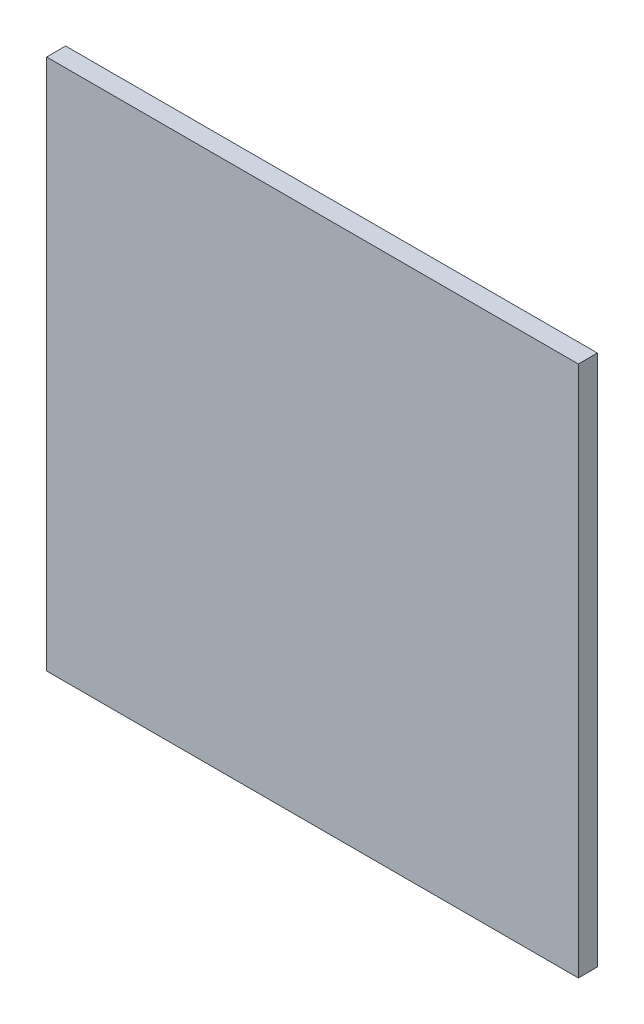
ISO-10303-21;
HEADER;
FILE_DESCRIPTION(('STEP AP214'),'2;1');
FILE_NAME('part.step','',(''),(''),'','','');
FILE_SCHEMA(('AUTOMOTIVE_DESIGN { 1 0 10303 214 1 1 1 1 }'));
ENDSEC;
DATA;
#1=APPLICATION_CONTEXT('core data for automotive mechanical design processes');
#2=APPLICATION_PROTOCOL_DEFINITION('international standard','automotive_design',2000,#1);
#3=PRODUCT_CONTEXT('',#1,'mechanical');
#4=PRODUCT('Part','Part','',(#3));
#5=PRODUCT_RELATED_PRODUCT_CATEGORY('part','',(#4));
#6=PRODUCT_DEFINITION_FORMATION('','',#4);
#7=PRODUCT_DEFINITION_CONTEXT('part definition',#1,'design');
#8=PRODUCT_DEFINITION('design','',#6,#7);
#9=PRODUCT_DEFINITION_SHAPE('','',#8);
#10=(LENGTH_UNIT() NAMED_UNIT(*) SI_UNIT(.MILLI.,.METRE.));
#11=(NAMED_UNIT(*) PLANE_ANGLE_UNIT() SI_UNIT($,.RADIAN.));
#12=(NAMED_UNIT(*) SI_UNIT($,.STERADIAN.) SOLID_ANGLE_UNIT());
#13=UNCERTAINTY_MEASURE_WITH_UNIT(LENGTH_MEASURE(1.E-05),#10,'distance_accuracy_value','');
#14=(GEOMETRIC_REPRESENTATION_CONTEXT(3) GLOBAL_UNCERTAINTY_ASSIGNED_CONTEXT((#13)) GLOBAL_UNIT_ASSIGNED_CONTEXT((#10,
#11,#12)) REPRESENTATION_CONTEXT('',''));
#15=CARTESIAN_POINT('',(0.,0.,0.));
#16=DIRECTION('',(0.,0.,1.));
#17=DIRECTION('',(1.,0.,0.));
#18=AXIS2_PLACEMENT_3D('',#15,#16,#17);
#19=CARTESIAN_POINT('',(139.7,139.7,10.));
#20=DIRECTION('',(-1.,0.,0.));
#21=DIRECTION('',(0.,-1.,0.));
#22=AXIS2_PLACEMENT_3D('',#19,#20,#21);
#23=PLANE('',#22);
#24=DIRECTION('',(0.,1.,0.));
#25=VECTOR('',#24,1.);
#26=CARTESIAN_POINT('',(139.7,139.7,0.));
#27=LINE('',#26,#25);
#28=CARTESIAN_POINT('',(139.7,-139.7,0.));
#29=VERTEX_POINT('',#28);
#30=CARTESIAN_POINT('',(139.7,139.7,0.));
#31=VERTEX_POINT('',#30);
#32=EDGE_CURVE('E103',#29,#31,#27,.T.);
#33=ORIENTED_EDGE('',*,*,#32,.T.);
#34=DIRECTION('',(0.,0.,-1.));
#35=VECTOR('',#34,1.);
#36=CARTESIAN_POINT('',(139.7,139.7,10.));
#37=LINE('',#36,#35);
#38=CARTESIAN_POINT('',(139.7,139.7,10.));
#39=VERTEX_POINT('',#38);
#40=EDGE_CURVE('E11',#39,#31,#37,.T.);
#41=ORIENTED_EDGE('',*,*,#40,.F.);
#42=DIRECTION('',(0.,1.,0.));
#43=VECTOR('',#42,1.);
#44=CARTESIAN_POINT('',(139.7,139.7,10.));
#45=LINE('',#44,#43);
#46=CARTESIAN_POINT('',(139.7,-139.7,10.));
#47=VERTEX_POINT('',#46);
#48=EDGE_CURVE('E91',#47,#39,#45,.T.);
#49=ORIENTED_EDGE('',*,*,#48,.F.);
#50=DIRECTION('',(0.,0.,-1.));
#51=VECTOR('',#50,1.);
#52=CARTESIAN_POINT('',(139.7,-139.7,10.));
#53=LINE('',#52,#51);
#54=EDGE_CURVE('E99',#47,#29,#53,.T.);
#55=ORIENTED_EDGE('',*,*,#54,.T.);
#56=EDGE_LOOP('',(#33,#41,#49,#55));
#57=FACE_BOUND('',#56,.T.);
#58=ADVANCED_FACE('F40',(#57),#23,.F.);
#59=CARTESIAN_POINT('',(-139.7,139.7,10.));
#60=DIRECTION('',(0.,-1.,0.));
#61=DIRECTION('',(0.,0.,-1.));
#62=AXIS2_PLACEMENT_3D('',#59,#60,#61);
#63=PLANE('',#62);
#64=DIRECTION('',(-1.,0.,0.));
#65=VECTOR('',#64,1.);
#66=CARTESIAN_POINT('',(-139.7,139.7,0.));
#67=LINE('',#66,#65);
#68=CARTESIAN_POINT('',(-139.7,139.7,0.));
#69=VERTEX_POINT('',#68);
#70=EDGE_CURVE('E95',#31,#69,#67,.T.);
#71=ORIENTED_EDGE('',*,*,#70,.T.);
#72=DIRECTION('',(0.,0.,-1.));
#73=VECTOR('',#72,1.);
#74=CARTESIAN_POINT('',(-139.7,139.7,10.));
#75=LINE('',#74,#73);
#76=CARTESIAN_POINT('',(-139.7,139.7,10.));
#77=VERTEX_POINT('',#76);
#78=EDGE_CURVE('E48',#77,#69,#75,.T.);
#79=ORIENTED_EDGE('',*,*,#78,.F.);
#80=DIRECTION('',(-1.,0.,0.));
#81=VECTOR('',#80,1.);
#82=CARTESIAN_POINT('',(-139.7,139.7,10.));
#83=LINE('',#82,#81);
#84=EDGE_CURVE('E86',#39,#77,#83,.T.);
#85=ORIENTED_EDGE('',*,*,#84,.F.);
#86=ORIENTED_EDGE('',*,*,#40,.T.);
#87=EDGE_LOOP('',(#71,#79,#85,#86));
#88=FACE_BOUND('',#87,.T.);
#89=ADVANCED_FACE('F94',(#88),#63,.F.);
#90=CARTESIAN_POINT('',(-139.7,139.7,10.));
#91=DIRECTION('',(1.,0.,0.));
#92=DIRECTION('',(0.,0.,-1.));
#93=AXIS2_PLACEMENT_3D('',#90,#91,#92);
#94=PLANE('',#93);
#95=DIRECTION('',(0.,-1.,0.));
#96=VECTOR('',#95,1.);
#97=CARTESIAN_POINT('',(-139.7,139.7,0.));
#98=LINE('',#97,#96);
#99=CARTESIAN_POINT('',(-139.7,-139.7,0.));
#100=VERTEX_POINT('',#99);
#101=EDGE_CURVE('E73',#69,#100,#98,.T.);
#102=ORIENTED_EDGE('',*,*,#101,.T.);
#103=DIRECTION('',(0.,0.,-1.));
#104=VECTOR('',#103,1.);
#105=CARTESIAN_POINT('',(-139.7,-139.7,10.));
#106=LINE('',#105,#104);
#107=CARTESIAN_POINT('',(-139.7,-139.7,10.));
#108=VERTEX_POINT('',#107);
#109=EDGE_CURVE('E96',#108,#100,#106,.T.);
#110=ORIENTED_EDGE('',*,*,#109,.F.);
#111=DIRECTION('',(0.,-1.,0.));
#112=VECTOR('',#111,1.);
#113=CARTESIAN_POINT('',(-139.7,139.7,10.));
#114=LINE('',#113,#112);
#115=EDGE_CURVE('E89',#77,#108,#114,.T.);
#116=ORIENTED_EDGE('',*,*,#115,.F.);
#117=ORIENTED_EDGE('',*,*,#78,.T.);
#118=EDGE_LOOP('',(#102,#110,#116,#117));
#119=FACE_BOUND('',#118,.T.);
#120=ADVANCED_FACE('F97',(#119),#94,.F.);
#121=CARTESIAN_POINT('',(-139.7,-139.7,10.));
#122=DIRECTION('',(0.,1.,0.));
#123=DIRECTION('',(0.,0.,1.));
#124=AXIS2_PLACEMENT_3D('',#121,#122,#123);
#125=PLANE('',#124);
#126=DIRECTION('',(1.,0.,0.));
#127=VECTOR('',#126,1.);
#128=CARTESIAN_POINT('',(-139.7,-139.7,0.));
#129=LINE('',#128,#127);
#130=EDGE_CURVE('E79',#100,#29,#129,.T.);
#131=ORIENTED_EDGE('',*,*,#130,.T.);
#132=ORIENTED_EDGE('',*,*,#54,.F.);
#133=DIRECTION('',(1.,0.,0.));
#134=VECTOR('',#133,1.);
#135=CARTESIAN_POINT('',(-139.7,-139.7,10.));
#136=LINE('',#135,#134);
#137=EDGE_CURVE('E56',#108,#47,#136,.T.);
#138=ORIENTED_EDGE('',*,*,#137,.F.);
#139=ORIENTED_EDGE('',*,*,#109,.T.);
#140=EDGE_LOOP('',(#131,#132,#138,#139));
#141=FACE_BOUND('',#140,.T.);
#142=ADVANCED_FACE('F110',(#141),#125,.F.);
#143=CARTESIAN_POINT('',(0.,0.,10.));
#144=DIRECTION('',(0.,0.,1.));
#145=DIRECTION('',(1.,0.,0.));
#146=AXIS2_PLACEMENT_3D('',#143,#144,#145);
#147=PLANE('',#146);
#148=ORIENTED_EDGE('',*,*,#48,.T.);
#149=ORIENTED_EDGE('',*,*,#84,.T.);
#150=ORIENTED_EDGE('',*,*,#115,.T.);
#151=ORIENTED_EDGE('',*,*,#137,.T.);
#152=EDGE_LOOP('',(#148,#149,#150,#151));
#153=FACE_BOUND('',#152,.T.);
#154=ADVANCED_FACE('F87',(#153),#147,.T.);
#155=CARTESIAN_POINT('',(0.,0.,0.));
#156=DIRECTION('',(0.,0.,1.));
#157=DIRECTION('',(1.,0.,0.));
#158=AXIS2_PLACEMENT_3D('',#155,#156,#157);
#159=PLANE('',#158);
#160=ORIENTED_EDGE('',*,*,#32,.F.);
#161=ORIENTED_EDGE('',*,*,#130,.F.);
#162=ORIENTED_EDGE('',*,*,#101,.F.);
#163=ORIENTED_EDGE('',*,*,#70,.F.);
#164=EDGE_LOOP('',(#160,#161,#162,#163));
#165=FACE_BOUND('',#164,.T.);
#166=ADVANCED_FACE('F113',(#165),#159,.F.);
#167=CLOSED_SHELL('',(#58,#89,#120,#142,#154,#166));
#168=MANIFOLD_SOLID_BREP('B2',#167);
#169=ADVANCED_BREP_SHAPE_REPRESENTATION('',(#18,#168),#14);
#170=SHAPE_DEFINITION_REPRESENTATION(#9,#169);
ENDSEC;
END-ISO-10303-21;
